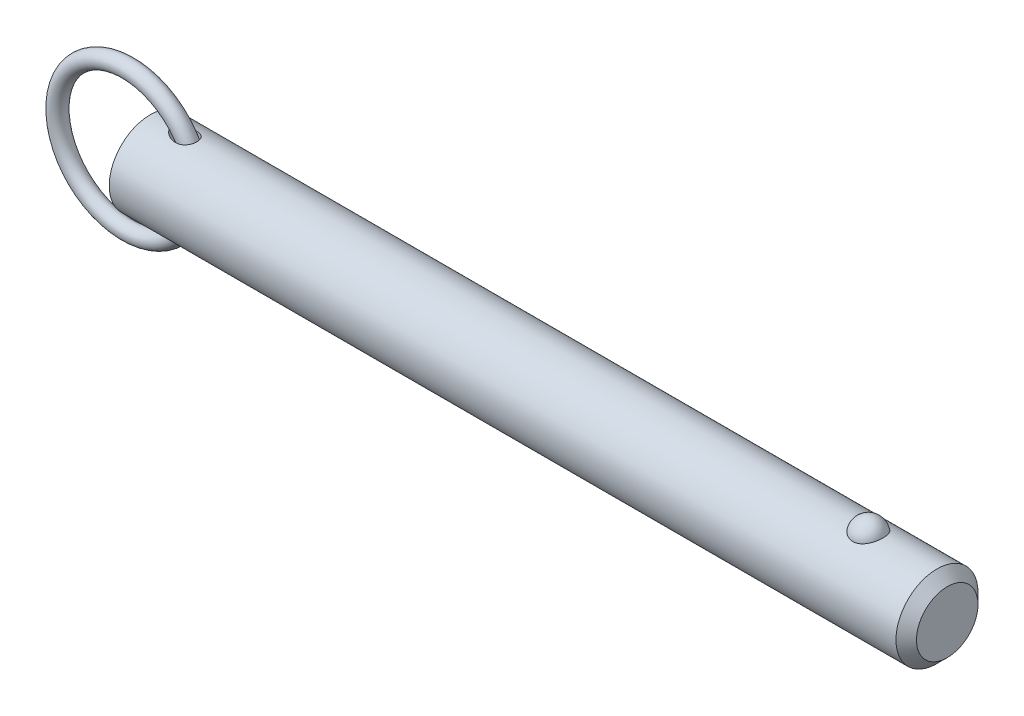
ISO-10303-21;
HEADER;
FILE_DESCRIPTION(('STEP AP214'),'2;1');
FILE_NAME('part.step','',(''),(''),'','','');
FILE_SCHEMA(('AUTOMOTIVE_DESIGN { 1 0 10303 214 1 1 1 1 }'));
ENDSEC;
DATA;
#1=APPLICATION_CONTEXT('core data for automotive mechanical design processes');
#2=APPLICATION_PROTOCOL_DEFINITION('international standard','automotive_design',2000,#1);
#3=PRODUCT_CONTEXT('',#1,'mechanical');
#4=PRODUCT('Part','Part','',(#3));
#5=PRODUCT_RELATED_PRODUCT_CATEGORY('part','',(#4));
#6=PRODUCT_DEFINITION_FORMATION('','',#4);
#7=PRODUCT_DEFINITION_CONTEXT('part definition',#1,'design');
#8=PRODUCT_DEFINITION('design','',#6,#7);
#9=PRODUCT_DEFINITION_SHAPE('','',#8);
#10=(LENGTH_UNIT() NAMED_UNIT(*) SI_UNIT(.MILLI.,.METRE.));
#11=(NAMED_UNIT(*) PLANE_ANGLE_UNIT() SI_UNIT($,.RADIAN.));
#12=(NAMED_UNIT(*) SI_UNIT($,.STERADIAN.) SOLID_ANGLE_UNIT());
#13=UNCERTAINTY_MEASURE_WITH_UNIT(LENGTH_MEASURE(1.E-05),#10,'distance_accuracy_value','');
#14=(GEOMETRIC_REPRESENTATION_CONTEXT(3) GLOBAL_UNCERTAINTY_ASSIGNED_CONTEXT((#13)) GLOBAL_UNIT_ASSIGNED_CONTEXT((#10,
#11,#12)) REPRESENTATION_CONTEXT('',''));
#15=CARTESIAN_POINT('',(0.,0.,0.));
#16=DIRECTION('',(0.,0.,1.));
#17=DIRECTION('',(1.,0.,0.));
#18=AXIS2_PLACEMENT_3D('',#15,#16,#17);
#19=CARTESIAN_POINT('',(-6.08699288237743,0.,0.));
#20=DIRECTION('',(0.,0.,1.));
#21=DIRECTION('',(1.,0.,0.));
#22=AXIS2_PLACEMENT_3D('',#19,#20,#21);
#23=TOROIDAL_SURFACE('',#22,19.05,2.223);
#24=CARTESIAN_POINT('',(15.1860071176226,0.,0.));
#25=VERTEX_POINT('',#24);
#26=VERTEX_LOOP('',#25);
#27=FACE_BOUND('',#26,.T.);
#28=ADVANCED_FACE('P0_F12',(#27),#23,.T.);
#29=CLOSED_SHELL('',(#28));
#30=MANIFOLD_SOLID_BREP('P0_B1',#29);
#31=CARTESIAN_POINT('',(0.,0.,0.));
#32=DIRECTION('',(1.,0.,0.));
#33=DIRECTION('',(0.,0.,-1.));
#34=AXIS2_PLACEMENT_3D('',#31,#32,#33);
#35=CYLINDRICAL_SURFACE('',#34,11.115);
#36=CARTESIAN_POINT('',(6.41405181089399,11.0227946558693,-1.4287136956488));
#37=CARTESIAN_POINT('',(6.49338916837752,11.0115377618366,-1.51556642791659));
#38=CARTESIAN_POINT('',(6.57765461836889,10.9998263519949,-1.59789397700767));
#39=CARTESIAN_POINT('',(6.75386647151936,10.9760304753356,-1.75391400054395));
#40=CARTESIAN_POINT('',(6.84582247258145,10.9639455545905,-1.82759540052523));
#41=CARTESIAN_POINT('',(7.03627827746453,10.9397989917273,-1.96698954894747));
#42=CARTESIAN_POINT('',(7.1348083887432,10.9277377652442,-2.03266078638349));
#43=CARTESIAN_POINT('',(7.33681032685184,10.9041015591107,-2.1558582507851));
#44=CARTESIAN_POINT('',(7.44028007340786,10.8925263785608,-2.21338786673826));
#45=CARTESIAN_POINT('',(7.64386117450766,10.8710104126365,-2.31666528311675));
#46=CARTESIAN_POINT('',(7.74368989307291,10.8610119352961,-2.36295942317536));
#47=CARTESIAN_POINT('',(7.94637195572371,10.8420168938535,-2.44863486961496));
#48=CARTESIAN_POINT('',(8.0492261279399,10.8330206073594,-2.48801426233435));
#49=CARTESIAN_POINT('',(8.36115573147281,10.807980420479,-2.59542730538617));
#50=CARTESIAN_POINT('',(8.57411849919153,10.7938278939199,-2.65299817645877));
#51=CARTESIAN_POINT('',(9.00825016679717,10.7725818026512,-2.73800108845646));
#52=CARTESIAN_POINT('',(9.22947335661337,10.7655491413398,-2.76517330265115));
#53=CARTESIAN_POINT('',(9.6736814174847,10.7605872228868,-2.78445308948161));
#54=CARTESIAN_POINT('',(9.89666486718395,10.7626512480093,-2.77658653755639));
#55=CARTESIAN_POINT('',(10.2950172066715,10.7754452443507,-2.72644436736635));
#56=CARTESIAN_POINT('',(10.4712789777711,10.7844280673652,-2.69109376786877));
#57=CARTESIAN_POINT('',(10.7292776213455,10.8024982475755,-2.61722365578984));
#58=CARTESIAN_POINT('',(10.8142337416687,10.8092901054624,-2.58911576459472));
#59=CARTESIAN_POINT('',(10.9813218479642,10.8242580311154,-2.52581287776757));
#60=CARTESIAN_POINT('',(11.0634550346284,10.8324335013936,-2.49062094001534));
#61=CARTESIAN_POINT('',(11.2247418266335,10.8500287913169,-2.41281958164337));
#62=CARTESIAN_POINT('',(11.3038694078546,10.8594572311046,-2.37015806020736));
#63=CARTESIAN_POINT('',(11.4576781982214,10.8792243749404,-2.27770403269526));
#64=CARTESIAN_POINT('',(11.5323615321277,10.8895626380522,-2.22791497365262));
#65=CARTESIAN_POINT('',(11.6765388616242,10.9108113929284,-2.12140590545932));
#66=CARTESIAN_POINT('',(11.7460329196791,10.9217218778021,-2.064685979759));
#67=CARTESIAN_POINT('',(11.8790597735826,10.9437207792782,-1.94471764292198));
#68=CARTESIAN_POINT('',(11.9425932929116,10.9548091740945,-1.88147002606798));
#69=CARTESIAN_POINT('',(12.109388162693,10.9851999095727,-1.69784918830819));
#70=CARTESIAN_POINT('',(12.205655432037,11.0042655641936,-1.57093023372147));
#71=CARTESIAN_POINT('',(12.374151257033,11.0393391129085,-1.3017676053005));
#72=CARTESIAN_POINT('',(12.4463875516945,11.0553479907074,-1.15952888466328));
#73=CARTESIAN_POINT('',(12.5615818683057,11.0816338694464,-0.871972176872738));
#74=CARTESIAN_POINT('',(12.6058896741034,11.0921698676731,-0.727217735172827));
#75=CARTESIAN_POINT('',(12.6699315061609,11.1075802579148,-0.43208997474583));
#76=CARTESIAN_POINT('',(12.6896681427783,11.1124552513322,-0.281717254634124));
#77=CARTESIAN_POINT('',(12.704022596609,11.1159901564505,0.0188164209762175));
#78=CARTESIAN_POINT('',(12.6988836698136,11.1147102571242,0.16896512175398));
#79=CARTESIAN_POINT('',(12.6641681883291,11.1062126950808,0.466238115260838));
#80=CARTESIAN_POINT('',(12.6345920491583,11.0989951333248,0.613362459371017));
#81=CARTESIAN_POINT('',(12.5517453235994,11.0794095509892,0.900330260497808));
#82=CARTESIAN_POINT('',(12.4984878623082,11.0670443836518,1.04017770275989));
#83=CARTESIAN_POINT('',(12.3696588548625,11.0385082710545,1.308745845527));
#84=CARTESIAN_POINT('',(12.2940887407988,11.0223375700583,1.43746725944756));
#85=CARTESIAN_POINT('',(12.122380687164,10.987872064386,1.68079704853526));
#86=CARTESIAN_POINT('',(12.0261637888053,10.969569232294,1.79534850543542));
#87=CARTESIAN_POINT('',(11.8161707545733,10.932836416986,2.00695695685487));
#88=CARTESIAN_POINT('',(11.7023941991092,10.9144064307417,2.10401353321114));
#89=CARTESIAN_POINT('',(11.4575656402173,10.8788057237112,2.28105326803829));
#90=CARTESIAN_POINT('',(11.3261451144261,10.8616794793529,2.36053412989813));
#91=CARTESIAN_POINT('',(11.0523589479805,10.8308019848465,2.49839044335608));
#92=CARTESIAN_POINT('',(10.9099908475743,10.8170514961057,2.55676113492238));
#93=CARTESIAN_POINT('',(10.6060622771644,10.7929728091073,2.65666105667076));
#94=CARTESIAN_POINT('',(10.4438877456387,10.7830209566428,2.69640163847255));
#95=CARTESIAN_POINT('',(10.1154037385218,10.7687230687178,2.75293129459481));
#96=CARTESIAN_POINT('',(9.94909141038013,10.7643810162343,2.76970406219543));
#97=CARTESIAN_POINT('',(9.54387061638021,10.7604809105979,2.7848723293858));
#98=CARTESIAN_POINT('',(9.30446860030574,10.7637793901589,2.7722775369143));
#99=CARTESIAN_POINT('',(8.94961255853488,10.7757341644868,2.72524141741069));
#100=CARTESIAN_POINT('',(8.83186896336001,10.7808994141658,2.70482239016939));
#101=CARTESIAN_POINT('',(8.59835142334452,10.7932548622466,2.65509992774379));
#102=CARTESIAN_POINT('',(8.48257728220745,10.8004448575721,2.62579738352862));
#103=CARTESIAN_POINT('',(8.25208469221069,10.8166382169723,2.55827624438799));
#104=CARTESIAN_POINT('',(8.13740214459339,10.8256649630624,2.51994155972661));
#105=CARTESIAN_POINT('',(7.91132058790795,10.8451170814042,2.43486475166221));
#106=CARTESIAN_POINT('',(7.79992154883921,10.8555424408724,2.38812270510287));
#107=CARTESIAN_POINT('',(7.58115677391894,10.8774251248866,2.28638483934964));
#108=CARTESIAN_POINT('',(7.47378802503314,10.8888816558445,2.23139534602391));
#109=CARTESIAN_POINT('',(7.26385624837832,10.9124540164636,2.11310265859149));
#110=CARTESIAN_POINT('',(7.16129168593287,10.9245696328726,2.04980214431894));
#111=CARTESIAN_POINT('',(6.91882218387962,10.9543689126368,1.88540538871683));
#112=CARTESIAN_POINT('',(6.7819377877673,10.9721958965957,1.77979827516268));
#113=CARTESIAN_POINT('',(6.52472441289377,11.0070222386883,1.5498969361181));
#114=CARTESIAN_POINT('',(6.40436902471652,11.0240228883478,1.42563320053));
#115=CARTESIAN_POINT('',(6.2183880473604,11.0509658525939,1.19529359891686));
#116=CARTESIAN_POINT('',(6.14691885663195,11.0615430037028,1.09404520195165));
#117=CARTESIAN_POINT('',(6.02043496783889,11.0805004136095,0.881508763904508));
#118=CARTESIAN_POINT('',(5.96539400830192,11.0888841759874,0.7702371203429));
#119=CARTESIAN_POINT('',(5.88475453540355,11.1012553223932,0.560577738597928));
#120=CARTESIAN_POINT('',(5.85559643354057,11.1057686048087,0.463603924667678));
#121=CARTESIAN_POINT('',(5.81381299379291,11.1122523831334,0.266083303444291));
#122=CARTESIAN_POINT('',(5.80117118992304,11.1142254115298,0.165540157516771));
#123=CARTESIAN_POINT('',(5.79363815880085,11.1153999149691,-0.0364747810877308));
#124=CARTESIAN_POINT('',(5.79878799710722,11.1145949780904,-0.137948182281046));
#125=CARTESIAN_POINT('',(5.82639592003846,11.1102987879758,-0.338493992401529));
#126=CARTESIAN_POINT('',(5.8488723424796,11.1068046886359,-0.437563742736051));
#127=CARTESIAN_POINT('',(5.91510741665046,11.0965857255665,-0.649968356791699));
#128=CARTESIAN_POINT('',(5.96220905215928,11.0893566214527,-0.762222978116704));
#129=CARTESIAN_POINT('',(6.07378449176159,11.072471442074,-0.977396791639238));
#130=CARTESIAN_POINT('',(6.13826787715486,11.0628140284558,-1.08031079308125));
#131=CARTESIAN_POINT('',(6.24101077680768,11.0477136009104,-1.2219580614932));
#132=CARTESIAN_POINT('',(6.27403486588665,11.042895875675,-1.26469183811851));
#133=CARTESIAN_POINT('',(6.3423802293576,11.0330152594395,-1.34817011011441));
#134=CARTESIAN_POINT('',(6.37769867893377,11.0279526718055,-1.38891694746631));
#135=CARTESIAN_POINT('',(6.41405181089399,11.0227946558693,-1.4287136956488));
#136=B_SPLINE_CURVE_WITH_KNOTS('',3,(#36,#37,#38,#39,#40,#41,#42,#43,#44,#45,#46,#47,#48,#49,
#50,#51,#52,#53,#54,#55,#56,#57,#58,#59,#60,#61,#62,#63,#64,#65,#66,#67,#68,#69,#70,#71,#72,#73,
#74,#75,#76,#77,#78,#79,#80,#81,#82,#83,#84,#85,#86,#87,#88,#89,#90,#91,#92,#93,#94,#95,#96,#97,
#98,#99,#100,#101,#102,#103,#104,#105,#106,#107,#108,#109,#110,#111,#112,#113,#114,#115,#116,
#117,#118,#119,#120,#121,#122,#123,#124,#125,#126,#127,#128,#129,#130,#131,#132,#133,#134,#135),
.UNSPECIFIED.,.T.,.F.,(4,2,2,2,2,2,2,2,2,2,2,2,2,2,2,2,2,2,2,2,2,2,2,2,2,2,2,2,2,2,2,2,2,2,2,2,
2,2,2,2,2,2,2,2,2,2,2,2,2,4),(0.,0.354433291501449,0.709315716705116,1.0659654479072,
1.42246628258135,1.7536715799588,2.08496839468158,2.74582009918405,3.41227815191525,
4.07824412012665,4.61583787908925,4.88478112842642,5.1536085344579,5.42439170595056,
5.69504436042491,5.96569375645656,6.23631025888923,6.7149072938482,7.1933500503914,
7.6464143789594,8.09943057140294,8.54802575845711,8.99661331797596,9.44495256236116,
9.89326303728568,10.3433195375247,10.7933867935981,11.2550086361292,11.7167345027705,
12.2165866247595,12.7167934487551,13.4318876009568,13.7904664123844,14.1490092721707,
14.5124394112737,14.8758662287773,15.239015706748,15.6020483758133,16.1219860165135,
16.6410830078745,17.0130520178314,17.3844231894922,17.6872330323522,17.9897407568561,
18.2929471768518,18.5964749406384,18.9603532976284,19.3244326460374,19.4870338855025,
19.649438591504),.UNSPECIFIED.);
#137=CARTESIAN_POINT('',(6.41405181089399,11.0227946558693,-1.4287136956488));
#138=VERTEX_POINT('',#137);
#139=EDGE_CURVE('P1_E40',#138,#138,#136,.T.);
#140=ORIENTED_EDGE('',*,*,#139,.T.);
#141=EDGE_LOOP('',(#140));
#142=FACE_BOUND('',#141,.T.);
#143=CARTESIAN_POINT('',(213.12125,0.,0.));
#144=DIRECTION('',(1.,0.,0.));
#145=DIRECTION('',(0.,0.,-1.));
#146=AXIS2_PLACEMENT_3D('',#143,#144,#145);
#147=CIRCLE('',#146,11.115);
#148=CARTESIAN_POINT('',(213.12125,0.,-11.115));
#149=VERTEX_POINT('',#148);
#150=EDGE_CURVE('P1_E25',#149,#149,#147,.T.);
#151=ORIENTED_EDGE('',*,*,#150,.F.);
#152=EDGE_LOOP('',(#151));
#153=FACE_BOUND('',#152,.T.);
#154=CARTESIAN_POINT('',(0.,0.,0.));
#155=DIRECTION('',(1.,0.,0.));
#156=DIRECTION('',(0.,0.,-1.));
#157=AXIS2_PLACEMENT_3D('',#154,#155,#156);
#158=CIRCLE('',#157,11.115);
#159=CARTESIAN_POINT('',(0.,0.,-11.115));
#160=VERTEX_POINT('',#159);
#161=EDGE_CURVE('P1_E9',#160,#160,#158,.T.);
#162=ORIENTED_EDGE('',*,*,#161,.T.);
#163=EDGE_LOOP('',(#162));
#164=FACE_BOUND('',#163,.T.);
#165=CARTESIAN_POINT('',(194.531068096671,10.3028087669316,4.17077409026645));
#166=CARTESIAN_POINT('',(194.314775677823,10.3028003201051,4.17078240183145));
#167=CARTESIAN_POINT('',(194.098548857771,10.3098895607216,4.15340593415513));
#168=CARTESIAN_POINT('',(193.672540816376,10.3373834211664,4.08449540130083));
#169=CARTESIAN_POINT('',(193.462757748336,10.3577841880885,4.0329712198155));
#170=CARTESIAN_POINT('',(193.055782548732,10.4095237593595,3.89746513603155));
#171=CARTESIAN_POINT('',(192.858572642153,10.4408466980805,3.81353029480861));
#172=CARTESIAN_POINT('',(192.481338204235,10.5110236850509,3.61560339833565));
#173=CARTESIAN_POINT('',(192.301317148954,10.5498792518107,3.50160528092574));
#174=CARTESIAN_POINT('',(191.957684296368,10.6322884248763,3.24292464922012));
#175=CARTESIAN_POINT('',(191.794686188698,10.6759443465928,3.0974604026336));
#176=CARTESIAN_POINT('',(191.494591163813,10.7625291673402,2.78171925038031));
#177=CARTESIAN_POINT('',(191.357499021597,10.8054579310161,2.61143778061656));
#178=CARTESIAN_POINT('',(191.106408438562,10.8881935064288,2.24226695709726));
#179=CARTESIAN_POINT('',(190.993710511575,10.9277761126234,2.04244123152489));
#180=CARTESIAN_POINT('',(190.801777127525,10.997484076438,1.62578254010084));
#181=CARTESIAN_POINT('',(190.722544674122,11.0276085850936,1.40894804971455));
#182=CARTESIAN_POINT('',(190.598303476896,11.0756732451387,0.961250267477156));
#183=CARTESIAN_POINT('',(190.553760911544,11.0934470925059,0.730239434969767));
#184=CARTESIAN_POINT('',(190.501569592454,11.1143331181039,0.26343964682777));
#185=CARTESIAN_POINT('',(190.493920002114,11.1174456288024,0.0276507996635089));
#186=CARTESIAN_POINT('',(190.51561056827,11.1087161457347,-0.440729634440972));
#187=CARTESIAN_POINT('',(190.544762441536,11.0969502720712,-0.6733313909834));
#188=CARTESIAN_POINT('',(190.639143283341,11.0597872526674,-1.12996621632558));
#189=CARTESIAN_POINT('',(190.704372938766,11.0343898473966,-1.35399912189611));
#190=CARTESIAN_POINT('',(190.86969844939,10.972515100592,-1.78750286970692));
#191=CARTESIAN_POINT('',(190.96983863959,10.9360236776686,-1.99695478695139));
#192=CARTESIAN_POINT('',(191.202940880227,10.8557595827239,-2.3952066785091));
#193=CARTESIAN_POINT('',(191.335905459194,10.8119863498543,-2.5840050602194));
#194=CARTESIAN_POINT('',(191.632407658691,10.7216733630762,-2.93635726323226));
#195=CARTESIAN_POINT('',(191.796056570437,10.675123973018,-3.09981510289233));
#196=CARTESIAN_POINT('',(192.149860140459,10.5846571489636,-3.39592247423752));
#197=CARTESIAN_POINT('',(192.340012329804,10.5407394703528,-3.52857487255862));
#198=CARTESIAN_POINT('',(192.73750141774,10.4616690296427,-3.75646057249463));
#199=CARTESIAN_POINT('',(192.94436705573,10.4263443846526,-3.85245432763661));
#200=CARTESIAN_POINT('',(193.372954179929,10.3675574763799,-4.00798747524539));
#201=CARTESIAN_POINT('',(193.594670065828,10.344090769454,-4.0675405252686));
#202=CARTESIAN_POINT('',(194.034669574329,10.3128282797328,-4.14614314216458));
#203=CARTESIAN_POINT('',(194.252565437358,10.3043040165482,-4.1670783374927));
#204=CARTESIAN_POINT('',(194.68894951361,10.3016771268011,-4.17357158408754));
#205=CARTESIAN_POINT('',(194.907437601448,10.3075716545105,-4.15913661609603));
#206=CARTESIAN_POINT('',(195.331744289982,10.3326686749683,-4.09636961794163));
#207=CARTESIAN_POINT('',(195.537745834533,10.3514555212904,-4.0490957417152));
#208=CARTESIAN_POINT('',(195.938576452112,10.399818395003,-3.92320197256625));
#209=CARTESIAN_POINT('',(196.1334046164,10.4293952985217,-3.84457953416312));
#210=CARTESIAN_POINT('',(196.511191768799,10.4969600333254,-3.65612410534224));
#211=CARTESIAN_POINT('',(196.693797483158,10.5351178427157,-3.54564545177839));
#212=CARTESIAN_POINT('',(197.038204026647,10.6154999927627,-3.29718036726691));
#213=CARTESIAN_POINT('',(197.200000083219,10.657725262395,-3.15918764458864));
#214=CARTESIAN_POINT('',(197.506959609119,10.744212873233,-2.85163580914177));
#215=CARTESIAN_POINT('',(197.650891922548,10.7884718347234,-2.68084605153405));
#216=CARTESIAN_POINT('',(197.909237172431,10.872374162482,-2.31721864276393));
#217=CARTESIAN_POINT('',(198.023644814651,10.9120167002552,-2.12437704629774));
#218=CARTESIAN_POINT('',(198.223873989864,10.9838919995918,-1.71516999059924));
#219=CARTESIAN_POINT('',(198.30866178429,11.0158465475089,-1.49824866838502));
#220=CARTESIAN_POINT('',(198.44268382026,11.0673523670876,-1.05228572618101));
#221=CARTESIAN_POINT('',(198.491917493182,11.086903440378,-0.823243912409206));
#222=CARTESIAN_POINT('',(198.553891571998,11.1116323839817,-0.359087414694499));
#223=CARTESIAN_POINT('',(198.566566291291,11.1167843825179,-0.123962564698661));
#224=CARTESIAN_POINT('',(198.554973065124,11.1121144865,0.345220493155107));
#225=CARTESIAN_POINT('',(198.530705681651,11.1022928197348,0.579278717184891));
#226=CARTESIAN_POINT('',(198.445907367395,11.0687504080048,1.03866534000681));
#227=CARTESIAN_POINT('',(198.385529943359,11.0450885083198,1.26402641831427));
#228=CARTESIAN_POINT('',(198.229853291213,10.9863185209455,1.70076772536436));
#229=CARTESIAN_POINT('',(198.134551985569,10.9512097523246,1.91214712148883));
#230=CARTESIAN_POINT('',(197.910397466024,10.8729733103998,2.316083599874));
#231=CARTESIAN_POINT('',(197.781380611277,10.8298068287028,2.50854240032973));
#232=CARTESIAN_POINT('',(197.492732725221,10.7401896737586,2.86808766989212));
#233=CARTESIAN_POINT('',(197.333102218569,10.6937390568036,3.03517457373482));
#234=CARTESIAN_POINT('',(196.987534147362,10.6029321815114,3.33857581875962));
#235=CARTESIAN_POINT('',(196.801708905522,10.5585680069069,3.47501541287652));
#236=CARTESIAN_POINT('',(196.407875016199,10.4769321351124,3.71390897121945));
#237=CARTESIAN_POINT('',(196.199863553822,10.439661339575,3.81635861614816));
#238=CARTESIAN_POINT('',(195.754066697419,10.3749407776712,3.98910631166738));
#239=CARTESIAN_POINT('',(195.515234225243,10.3482457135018,4.05700929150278));
#240=CARTESIAN_POINT('',(195.027925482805,10.312188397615,4.14782844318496));
#241=CARTESIAN_POINT('',(194.779453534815,10.3028184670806,4.17076454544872));
#242=CARTESIAN_POINT('',(194.531068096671,10.3028087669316,4.17077409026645));
#243=B_SPLINE_CURVE_WITH_KNOTS('',3,(#165,#166,#167,#168,#169,#170,#171,#172,#173,#174,#175,
#176,#177,#178,#179,#180,#181,#182,#183,#184,#185,#186,#187,#188,#189,#190,#191,#192,#193,#194,
#195,#196,#197,#198,#199,#200,#201,#202,#203,#204,#205,#206,#207,#208,#209,#210,#211,#212,#213,
#214,#215,#216,#217,#218,#219,#220,#221,#222,#223,#224,#225,#226,#227,#228,#229,#230,#231,#232,
#233,#234,#235,#236,#237,#238,#239,#240,#241,#242),.UNSPECIFIED.,.T.,.F.,(4,2,2,2,2,2,2,2,2,2,2,
2,2,2,2,2,2,2,2,2,2,2,2,2,2,2,2,2,2,2,2,2,2,2,2,2,2,2,4),(0.,0.64796614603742,1.29574482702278,
1.94258643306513,2.58955857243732,3.25496465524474,3.92049326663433,4.61566368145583,
5.31089647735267,6.01531821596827,6.71972398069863,7.42054043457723,8.12137023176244,
8.82309331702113,9.5248704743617,10.2292439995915,10.9335519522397,11.6223330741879,
12.3108558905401,12.9647664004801,13.6185478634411,14.252184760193,14.8858731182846,
15.5334360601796,16.1811472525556,16.8611459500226,17.5412664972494,18.2431855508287,
18.9451158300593,19.6483065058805,20.3514864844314,21.0516982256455,21.7519516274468,
22.4556690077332,23.1593743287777,23.860149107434,24.5610129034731,25.3054529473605,
26.049562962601),.UNSPECIFIED.);
#244=CARTESIAN_POINT('',(194.531068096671,10.3028087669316,4.17077409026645));
#245=VERTEX_POINT('',#244);
#246=EDGE_CURVE('P1_E34',#245,#245,#243,.T.);
#247=ORIENTED_EDGE('',*,*,#246,.T.);
#248=EDGE_LOOP('',(#247));
#249=FACE_BOUND('',#248,.T.);
#250=CARTESIAN_POINT('',(6.41405181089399,-11.0227946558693,-1.4287136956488));
#251=CARTESIAN_POINT('',(6.33124061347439,-11.0345445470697,-1.33806125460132));
#252=CARTESIAN_POINT('',(6.25372866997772,-11.0458090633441,-1.24240732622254));
#253=CARTESIAN_POINT('',(6.11277905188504,-11.0666115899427,-1.04095704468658));
#254=CARTESIAN_POINT('',(6.04933920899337,-11.0761498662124,-0.935162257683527));
#255=CARTESIAN_POINT('',(5.94029181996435,-11.0927063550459,-0.712476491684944));
#256=CARTESIAN_POINT('',(5.89492964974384,-11.0996897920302,-0.595457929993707));
#257=CARTESIAN_POINT('',(5.84498161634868,-11.1074141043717,-0.414997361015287));
#258=CARTESIAN_POINT('',(5.83135004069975,-11.1095300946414,-0.354047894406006));
#259=CARTESIAN_POINT('',(5.81051649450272,-11.1127688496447,-0.231041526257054));
#260=CARTESIAN_POINT('',(5.80331311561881,-11.1138918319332,-0.168984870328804));
#261=CARTESIAN_POINT('',(5.79296529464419,-11.1155042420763,-0.000484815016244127));
#262=CARTESIAN_POINT('',(5.79625267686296,-11.1149904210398,0.106437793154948));
#263=CARTESIAN_POINT('',(5.82213676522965,-11.1109609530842,0.317809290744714));
#264=CARTESIAN_POINT('',(5.84474662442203,-11.1074432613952,0.42225644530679));
#265=CARTESIAN_POINT('',(5.911131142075,-11.097197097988,0.639361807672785));
#266=CARTESIAN_POINT('',(5.95733120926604,-11.090102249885,0.751250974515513));
#267=CARTESIAN_POINT('',(6.06709542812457,-11.0734770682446,0.965912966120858));
#268=CARTESIAN_POINT('',(6.13068735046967,-11.06394284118,1.06867085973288));
#269=CARTESIAN_POINT('',(6.30294237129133,-11.0385920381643,1.30890635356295));
#270=CARTESIAN_POINT('',(6.41896200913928,-11.0218881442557,1.44097376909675));
#271=CARTESIAN_POINT('',(6.6698965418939,-10.9871512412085,1.68553954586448));
#272=CARTESIAN_POINT('',(6.80485520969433,-10.9691152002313,1.79799117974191));
#273=CARTESIAN_POINT('',(7.04881236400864,-10.9382283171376,1.97587596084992));
#274=CARTESIAN_POINT('',(7.15465712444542,-10.9253240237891,2.04570822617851));
#275=CARTESIAN_POINT('',(7.37202504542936,-10.9000987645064,2.17611840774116));
#276=CARTESIAN_POINT('',(7.48355057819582,-10.8877780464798,2.23669241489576));
#277=CARTESIAN_POINT('',(7.71132418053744,-10.8641580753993,2.34873831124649));
#278=CARTESIAN_POINT('',(7.82757727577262,-10.8528599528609,2.40020018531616));
#279=CARTESIAN_POINT('',(8.06386825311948,-10.8317234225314,2.49385169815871));
#280=CARTESIAN_POINT('',(8.18390558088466,-10.8218848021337,2.53604268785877));
#281=CARTESIAN_POINT('',(8.42918336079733,-10.8039208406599,2.61152283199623));
#282=CARTESIAN_POINT('',(8.55447802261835,-10.7958283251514,2.64464414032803));
#283=CARTESIAN_POINT('',(8.80752127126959,-10.781995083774,2.70048793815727));
#284=CARTESIAN_POINT('',(8.93527019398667,-10.7762546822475,2.72320899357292));
#285=CARTESIAN_POINT('',(9.1921017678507,-10.7675291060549,2.75750994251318));
#286=CARTESIAN_POINT('',(9.32118105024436,-10.7645381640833,2.76911315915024));
#287=CARTESIAN_POINT('',(9.57984338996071,-10.761622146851,2.78042035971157));
#288=CARTESIAN_POINT('',(9.70942621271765,-10.7616957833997,2.78012934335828));
#289=CARTESIAN_POINT('',(10.0243125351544,-10.7659059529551,2.76381534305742));
#290=CARTESIAN_POINT('',(10.209307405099,-10.7717977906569,2.74099674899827));
#291=CARTESIAN_POINT('',(10.5731188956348,-10.7905408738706,2.66626238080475));
#292=CARTESIAN_POINT('',(10.7519389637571,-10.8033881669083,2.61436313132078));
#293=CARTESIAN_POINT('',(11.0114289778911,-10.8271584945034,2.51336808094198));
#294=CARTESIAN_POINT('',(11.096831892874,-10.835881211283,2.47562331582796));
#295=CARTESIAN_POINT('',(11.2636000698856,-10.8545688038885,2.39236170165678));
#296=CARTESIAN_POINT('',(11.3449673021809,-10.8645330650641,2.3468486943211));
#297=CARTESIAN_POINT('',(11.5027832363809,-10.8853818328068,2.24815967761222));
#298=CARTESIAN_POINT('',(11.5792327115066,-10.8962661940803,2.19498487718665));
#299=CARTESIAN_POINT('',(11.7263315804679,-10.9185541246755,2.08128855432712));
#300=CARTESIAN_POINT('',(11.7969818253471,-10.9299576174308,2.02076811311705));
#301=CARTESIAN_POINT('',(11.9817953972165,-10.9613645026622,1.84513663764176));
#302=CARTESIAN_POINT('',(12.0893012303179,-10.9814643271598,1.72286660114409));
#303=CARTESIAN_POINT('',(12.2803576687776,-11.0193991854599,1.46066991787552));
#304=CARTESIAN_POINT('',(12.3639173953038,-11.0372350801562,1.3207500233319));
#305=CARTESIAN_POINT('',(12.4996220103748,-11.0672969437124,1.03778067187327));
#306=CARTESIAN_POINT('',(12.5535315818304,-11.0798242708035,0.895607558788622));
#307=CARTESIAN_POINT('',(12.636874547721,-11.0995427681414,0.603918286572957));
#308=CARTESIAN_POINT('',(12.6663115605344,-11.1067347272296,0.454403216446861));
#309=CARTESIAN_POINT('',(12.6997387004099,-11.1149224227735,0.154577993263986));
#310=CARTESIAN_POINT('',(12.7040886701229,-11.1160057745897,0.00431019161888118));
#311=CARTESIAN_POINT('',(12.6882048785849,-11.1120956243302,-0.294841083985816));
#312=CARTESIAN_POINT('',(12.6679715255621,-11.1071022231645,-0.443724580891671));
#313=CARTESIAN_POINT('',(12.6034470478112,-11.0915888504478,-0.735688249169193));
#314=CARTESIAN_POINT('',(12.5591858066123,-11.0810757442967,-0.878775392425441));
#315=CARTESIAN_POINT('',(12.4477416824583,-11.0556687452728,-1.15529525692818));
#316=CARTESIAN_POINT('',(12.3805601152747,-11.0407751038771,-1.28872853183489));
#317=CARTESIAN_POINT('',(12.2248919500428,-11.0081839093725,-1.54257976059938));
#318=CARTESIAN_POINT('',(12.1363549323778,-10.9904797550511,-1.66296592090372));
#319=CARTESIAN_POINT('',(11.9406137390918,-10.9541951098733,-1.88726577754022));
#320=CARTESIAN_POINT('',(11.833409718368,-10.9356146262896,-1.9911796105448));
#321=CARTESIAN_POINT('',(11.601318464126,-10.8991360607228,-2.18213646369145));
#322=CARTESIAN_POINT('',(11.4761325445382,-10.8812577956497,-2.26881927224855));
#323=CARTESIAN_POINT('',(11.2134852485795,-10.8482871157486,-2.42157282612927));
#324=CARTESIAN_POINT('',(11.0760218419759,-10.8331951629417,-2.48764015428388));
#325=CARTESIAN_POINT('',(10.7828968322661,-10.8061050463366,-2.60290068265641));
#326=CARTESIAN_POINT('',(10.6266338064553,-10.7943907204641,-2.65062248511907));
#327=CARTESIAN_POINT('',(10.3086617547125,-10.7762429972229,-2.72345054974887));
#328=CARTESIAN_POINT('',(10.146948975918,-10.7698133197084,-2.74854088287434));
#329=CARTESIAN_POINT('',(9.75541304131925,-10.7608036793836,-2.78368719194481));
#330=CARTESIAN_POINT('',(9.52459435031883,-10.7608467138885,-2.78350276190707));
#331=CARTESIAN_POINT('',(9.0660496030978,-10.7702674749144,-2.74677945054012));
#332=CARTESIAN_POINT('',(8.83832966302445,-10.7796615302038,-2.71017697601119));
#333=CARTESIAN_POINT('',(8.38783466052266,-10.8058248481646,-2.60392490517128));
#334=CARTESIAN_POINT('',(8.16517101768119,-10.8226939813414,-2.53382676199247));
#335=CARTESIAN_POINT('',(7.84087311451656,-10.8516548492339,-2.40555545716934));
#336=CARTESIAN_POINT('',(7.73435551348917,-10.8619221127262,-2.35892455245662));
#337=CARTESIAN_POINT('',(7.52510420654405,-10.883357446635,-2.25797017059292));
#338=CARTESIAN_POINT('',(7.42236986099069,-10.8945253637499,-2.20364800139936));
#339=CARTESIAN_POINT('',(7.23808758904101,-10.915528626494,-2.09688018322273));
#340=CARTESIAN_POINT('',(7.15584631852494,-10.9252787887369,-2.0456107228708));
#341=CARTESIAN_POINT('',(6.99510576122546,-10.944960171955,-1.93754729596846));
#342=CARTESIAN_POINT('',(6.91660574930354,-10.9548913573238,-1.88075440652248));
#343=CARTESIAN_POINT('',(6.76418133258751,-10.974690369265,-1.76154504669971));
#344=CARTESIAN_POINT('',(6.69024940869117,-10.9845582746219,-1.6991382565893));
#345=CARTESIAN_POINT('',(6.54780119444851,-11.0039826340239,-1.56842485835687));
#346=CARTESIAN_POINT('',(6.47928247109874,-11.0135392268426,-1.50012092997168));
#347=CARTESIAN_POINT('',(6.41405181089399,-11.0227946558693,-1.4287136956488));
#348=B_SPLINE_CURVE_WITH_KNOTS('',3,(#250,#251,#252,#253,#254,#255,#256,#257,#258,#259,#260,
#261,#262,#263,#264,#265,#266,#267,#268,#269,#270,#271,#272,#273,#274,#275,#276,#277,#278,#279,
#280,#281,#282,#283,#284,#285,#286,#287,#288,#289,#290,#291,#292,#293,#294,#295,#296,#297,#298,
#299,#300,#301,#302,#303,#304,#305,#306,#307,#308,#309,#310,#311,#312,#313,#314,#315,#316,#317,
#318,#319,#320,#321,#322,#323,#324,#325,#326,#327,#328,#329,#330,#331,#332,#333,#334,#335,#336,
#337,#338,#339,#340,#341,#342,#343,#344,#345,#346,#347),.UNSPECIFIED.,.T.,.F.,(4,2,2,2,2,2,2,2,
2,2,2,2,2,2,2,2,2,2,2,2,2,2,2,2,2,2,2,2,2,2,2,2,2,2,2,2,2,2,2,2,2,2,2,2,2,2,2,2,4),(0.,
0.369835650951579,0.739614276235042,1.11425380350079,1.30141910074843,1.48854338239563,
1.80745879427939,2.12659146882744,2.48838884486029,2.85076733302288,3.3776216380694,
3.9057143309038,4.287639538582,4.66972556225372,5.05222896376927,5.43467659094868,
5.82378546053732,6.21294796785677,6.6012922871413,6.98947336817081,7.54669558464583,
8.10360148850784,8.38458539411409,8.66543074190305,8.94623182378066,9.22699162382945,
9.71628887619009,10.2053995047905,10.6608871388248,11.1163074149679,11.5651786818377,
12.0140424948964,12.4623493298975,12.9106304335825,13.3599804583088,13.8093267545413,
14.2672570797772,14.7252632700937,15.214740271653,15.7045615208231,16.3932594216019,
17.083162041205,17.7825738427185,18.1325177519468,18.4824022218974,18.7744056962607,
19.0663523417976,19.3578048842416,19.6491256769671),.UNSPECIFIED.);
#349=CARTESIAN_POINT('',(6.41405181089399,-11.0227946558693,-1.4287136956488));
#350=VERTEX_POINT('',#349);
#351=EDGE_CURVE('P1_E17',#350,#350,#348,.T.);
#352=ORIENTED_EDGE('',*,*,#351,.T.);
#353=EDGE_LOOP('',(#352));
#354=FACE_BOUND('',#353,.T.);
#355=ADVANCED_FACE('P1_F13',(#142,#153,#164,#249,#354),#35,.T.);
#356=CARTESIAN_POINT('',(0.,0.,0.));
#357=DIRECTION('',(-1.,0.,0.));
#358=DIRECTION('',(0.,0.,1.));
#359=AXIS2_PLACEMENT_3D('',#356,#357,#358);
#360=PLANE('',#359);
#361=ORIENTED_EDGE('',*,*,#161,.F.);
#362=EDGE_LOOP('',(#361));
#363=FACE_BOUND('',#362,.T.);
#364=ADVANCED_FACE('P1_F15',(#363),#360,.T.);
#365=CARTESIAN_POINT('',(215.9,0.,0.));
#366=DIRECTION('',(-1.,0.,0.));
#367=DIRECTION('',(0.,0.,1.));
#368=AXIS2_PLACEMENT_3D('',#365,#366,#367);
#369=CONICAL_SURFACE('',#368,8.33625000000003,0.785398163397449);
#370=ORIENTED_EDGE('',*,*,#150,.T.);
#371=EDGE_LOOP('',(#370));
#372=FACE_BOUND('',#371,.T.);
#373=CARTESIAN_POINT('',(215.9,0.,0.));
#374=DIRECTION('',(1.,0.,0.));
#375=DIRECTION('',(0.,0.,-1.));
#376=AXIS2_PLACEMENT_3D('',#373,#374,#375);
#377=CIRCLE('',#376,8.33625000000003);
#378=CARTESIAN_POINT('',(215.9,0.,-8.33625000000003));
#379=VERTEX_POINT('',#378);
#380=EDGE_CURVE('P1_E30',#379,#379,#377,.T.);
#381=ORIENTED_EDGE('',*,*,#380,.F.);
#382=EDGE_LOOP('',(#381));
#383=FACE_BOUND('',#382,.T.);
#384=ADVANCED_FACE('P1_F55',(#372,#383),#369,.T.);
#385=CARTESIAN_POINT('',(215.9,8.33625000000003,0.));
#386=DIRECTION('',(1.,0.,0.));
#387=DIRECTION('',(0.,0.,-1.));
#388=AXIS2_PLACEMENT_3D('',#385,#386,#387);
#389=PLANE('',#388);
#390=ORIENTED_EDGE('',*,*,#380,.T.);
#391=EDGE_LOOP('',(#390));
#392=FACE_BOUND('',#391,.T.);
#393=ADVANCED_FACE('P1_F51',(#392),#389,.T.);
#394=CARTESIAN_POINT('',(194.531068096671,10.0035,0.));
#395=DIRECTION('',(-1.,0.,0.));
#396=DIRECTION('',(0.,1.,0.));
#397=AXIS2_PLACEMENT_3D('',#394,#395,#396);
#398=SPHERICAL_SURFACE('',#397,4.18150000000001);
#399=ORIENTED_EDGE('',*,*,#246,.F.);
#400=EDGE_LOOP('',(#399));
#401=FACE_BOUND('',#400,.T.);
#402=ADVANCED_FACE('P1_F46',(#401),#398,.T.);
#403=CARTESIAN_POINT('',(-6.08699288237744,0.,0.));
#404=DIRECTION('',(0.,0.,1.));
#405=DIRECTION('',(1.,0.,0.));
#406=AXIS2_PLACEMENT_3D('',#403,#404,#405);
#407=TOROIDAL_SURFACE('',#406,19.05,2.77875);
#408=ORIENTED_EDGE('',*,*,#351,.F.);
#409=EDGE_LOOP('',(#408));
#410=FACE_BOUND('',#409,.T.);
#411=ORIENTED_EDGE('',*,*,#139,.F.);
#412=EDGE_LOOP('',(#411));
#413=FACE_BOUND('',#412,.T.);
#414=ADVANCED_FACE('P1_F50',(#410,#413),#407,.F.);
#415=CLOSED_SHELL('',(#355,#364,#384,#393,#402,#414));
#416=MANIFOLD_SOLID_BREP('P1_B1',#415);
#417=ADVANCED_BREP_SHAPE_REPRESENTATION('',(#18,#30,#416),#14);
#418=SHAPE_DEFINITION_REPRESENTATION(#9,#417);
ENDSEC;
END-ISO-10303-21;
